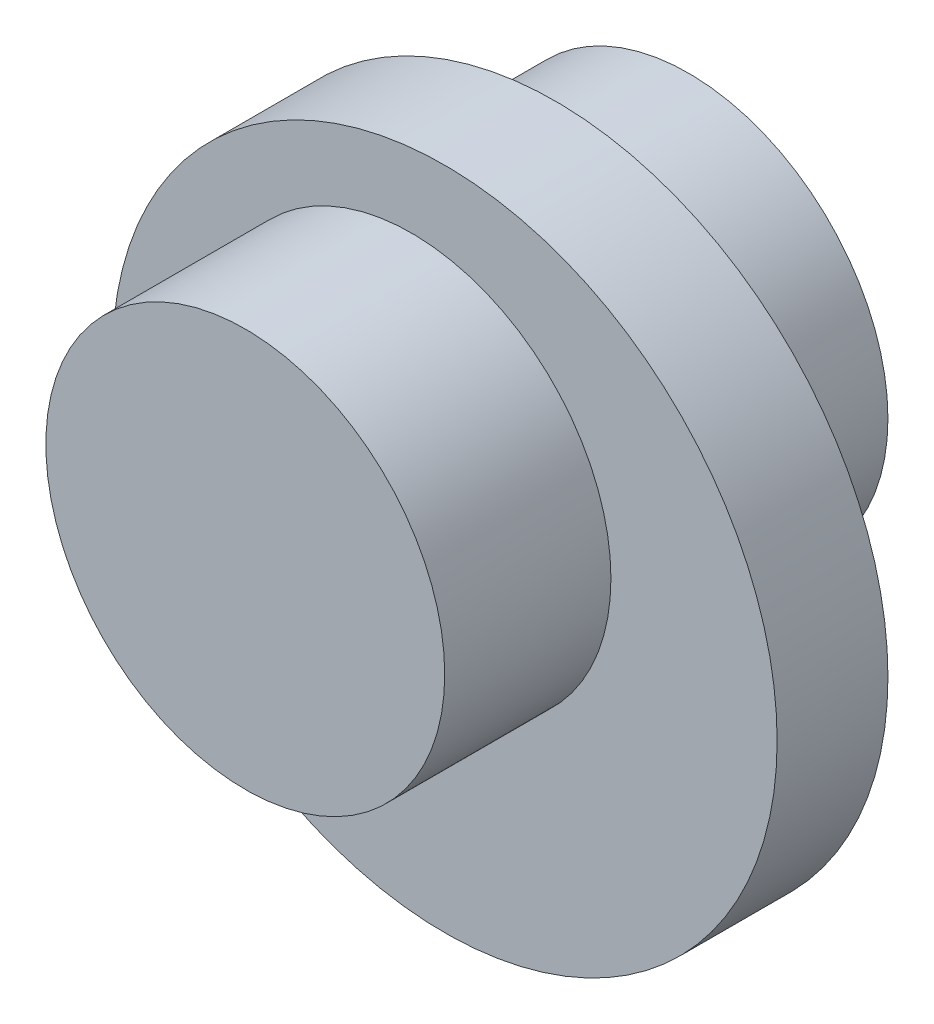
ISO-10303-21;
HEADER;
FILE_DESCRIPTION(('STEP AP214'),'2;1');
FILE_NAME('part.step','',(''),(''),'','','');
FILE_SCHEMA(('AUTOMOTIVE_DESIGN { 1 0 10303 214 1 1 1 1 }'));
ENDSEC;
DATA;
#1=APPLICATION_CONTEXT('core data for automotive mechanical design processes');
#2=APPLICATION_PROTOCOL_DEFINITION('international standard','automotive_design',2000,#1);
#3=PRODUCT_CONTEXT('',#1,'mechanical');
#4=PRODUCT('Part','Part','',(#3));
#5=PRODUCT_RELATED_PRODUCT_CATEGORY('part','',(#4));
#6=PRODUCT_DEFINITION_FORMATION('','',#4);
#7=PRODUCT_DEFINITION_CONTEXT('part definition',#1,'design');
#8=PRODUCT_DEFINITION('design','',#6,#7);
#9=PRODUCT_DEFINITION_SHAPE('','',#8);
#10=(LENGTH_UNIT() NAMED_UNIT(*) SI_UNIT(.MILLI.,.METRE.));
#11=(NAMED_UNIT(*) PLANE_ANGLE_UNIT() SI_UNIT($,.RADIAN.));
#12=(NAMED_UNIT(*) SI_UNIT($,.STERADIAN.) SOLID_ANGLE_UNIT());
#13=UNCERTAINTY_MEASURE_WITH_UNIT(LENGTH_MEASURE(1.E-05),#10,'distance_accuracy_value','');
#14=(GEOMETRIC_REPRESENTATION_CONTEXT(3) GLOBAL_UNCERTAINTY_ASSIGNED_CONTEXT((#13)) GLOBAL_UNIT_ASSIGNED_CONTEXT((#10,
#11,#12)) REPRESENTATION_CONTEXT('',''));
#15=CARTESIAN_POINT('',(0.,0.,0.));
#16=DIRECTION('',(0.,0.,1.));
#17=DIRECTION('',(1.,0.,0.));
#18=AXIS2_PLACEMENT_3D('',#15,#16,#17);
#19=CARTESIAN_POINT('',(0.,0.,10.));
#20=DIRECTION('',(0.,0.,-1.));
#21=DIRECTION('',(-1.,0.,0.));
#22=AXIS2_PLACEMENT_3D('',#19,#20,#21);
#23=CYLINDRICAL_SURFACE('',#22,9.);
#24=CARTESIAN_POINT('',(0.,0.,2.5));
#25=DIRECTION('',(0.,0.,1.));
#26=DIRECTION('',(1.,0.,0.));
#27=AXIS2_PLACEMENT_3D('',#24,#25,#26);
#28=CIRCLE('',#27,9.);
#29=CARTESIAN_POINT('',(9.,0.,2.5));
#30=VERTEX_POINT('',#29);
#31=EDGE_CURVE('E32',#30,#30,#28,.T.);
#32=ORIENTED_EDGE('',*,*,#31,.T.);
#33=EDGE_LOOP('',(#32));
#34=FACE_BOUND('',#33,.T.);
#35=CARTESIAN_POINT('',(0.,0.,10.));
#36=DIRECTION('',(0.,0.,1.));
#37=DIRECTION('',(1.,0.,0.));
#38=AXIS2_PLACEMENT_3D('',#35,#36,#37);
#39=CIRCLE('',#38,9.);
#40=CARTESIAN_POINT('',(9.,0.,10.));
#41=VERTEX_POINT('',#40);
#42=EDGE_CURVE('E36',#41,#41,#39,.T.);
#43=ORIENTED_EDGE('',*,*,#42,.F.);
#44=EDGE_LOOP('',(#43));
#45=FACE_BOUND('',#44,.T.);
#46=ADVANCED_FACE('F29',(#34,#45),#23,.T.);
#47=CARTESIAN_POINT('',(0.,0.,10.));
#48=DIRECTION('',(0.,0.,1.));
#49=DIRECTION('',(1.,0.,0.));
#50=AXIS2_PLACEMENT_3D('',#47,#48,#49);
#51=PLANE('',#50);
#52=ORIENTED_EDGE('',*,*,#42,.T.);
#53=EDGE_LOOP('',(#52));
#54=FACE_BOUND('',#53,.T.);
#55=ADVANCED_FACE('F60',(#54),#51,.T.);
#56=CARTESIAN_POINT('',(1.5,-2.59807621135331,2.5));
#57=DIRECTION('',(0.,0.,1.));
#58=DIRECTION('',(1.,0.,0.));
#59=AXIS2_PLACEMENT_3D('',#56,#57,#58);
#60=PLANE('',#59);
#61=CARTESIAN_POINT('',(1.5,-2.59807621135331,2.5));
#62=DIRECTION('',(0.,0.,1.));
#63=DIRECTION('',(1.,0.,0.));
#64=AXIS2_PLACEMENT_3D('',#61,#62,#63);
#65=CIRCLE('',#64,15.);
#66=CARTESIAN_POINT('',(16.5,-2.59807621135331,2.5));
#67=VERTEX_POINT('',#66);
#68=EDGE_CURVE('E48',#67,#67,#65,.T.);
#69=ORIENTED_EDGE('',*,*,#68,.T.);
#70=EDGE_LOOP('',(#69));
#71=FACE_BOUND('',#70,.T.);
#72=ORIENTED_EDGE('',*,*,#31,.F.);
#73=EDGE_LOOP('',(#72));
#74=FACE_BOUND('',#73,.T.);
#75=ADVANCED_FACE('F57',(#71,#74),#60,.T.);
#76=CARTESIAN_POINT('',(1.5,-2.59807621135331,-2.5));
#77=DIRECTION('',(0.,0.,1.));
#78=DIRECTION('',(1.,0.,0.));
#79=AXIS2_PLACEMENT_3D('',#76,#77,#78);
#80=PLANE('',#79);
#81=CARTESIAN_POINT('',(1.5,-2.59807621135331,-2.5));
#82=DIRECTION('',(0.,0.,1.));
#83=DIRECTION('',(1.,0.,0.));
#84=AXIS2_PLACEMENT_3D('',#81,#82,#83);
#85=CIRCLE('',#84,15.);
#86=CARTESIAN_POINT('',(16.5,-2.59807621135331,-2.5));
#87=VERTEX_POINT('',#86);
#88=EDGE_CURVE('E45',#87,#87,#85,.T.);
#89=ORIENTED_EDGE('',*,*,#88,.F.);
#90=EDGE_LOOP('',(#89));
#91=FACE_BOUND('',#90,.T.);
#92=CARTESIAN_POINT('',(0.,0.,-2.5));
#93=DIRECTION('',(0.,0.,1.));
#94=DIRECTION('',(1.,0.,0.));
#95=AXIS2_PLACEMENT_3D('',#92,#93,#94);
#96=CIRCLE('',#95,9.);
#97=CARTESIAN_POINT('',(9.,0.,-2.5));
#98=VERTEX_POINT('',#97);
#99=EDGE_CURVE('E10',#98,#98,#96,.T.);
#100=ORIENTED_EDGE('',*,*,#99,.T.);
#101=EDGE_LOOP('',(#100));
#102=FACE_BOUND('',#101,.T.);
#103=ADVANCED_FACE('F59',(#91,#102),#80,.F.);
#104=CARTESIAN_POINT('',(1.5,-2.59807621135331,2.5));
#105=DIRECTION('',(0.,0.,-1.));
#106=DIRECTION('',(-1.,0.,0.));
#107=AXIS2_PLACEMENT_3D('',#104,#105,#106);
#108=CYLINDRICAL_SURFACE('',#107,15.);
#109=ORIENTED_EDGE('',*,*,#68,.F.);
#110=EDGE_LOOP('',(#109));
#111=FACE_BOUND('',#110,.T.);
#112=ORIENTED_EDGE('',*,*,#88,.T.);
#113=EDGE_LOOP('',(#112));
#114=FACE_BOUND('',#113,.T.);
#115=ADVANCED_FACE('F66',(#111,#114),#108,.T.);
#116=CARTESIAN_POINT('',(0.,0.,-10.));
#117=DIRECTION('',(0.,0.,1.));
#118=DIRECTION('',(1.,0.,0.));
#119=AXIS2_PLACEMENT_3D('',#116,#117,#118);
#120=PLANE('',#119);
#121=CARTESIAN_POINT('',(0.,0.,-10.));
#122=DIRECTION('',(0.,0.,1.));
#123=DIRECTION('',(1.,0.,0.));
#124=AXIS2_PLACEMENT_3D('',#121,#122,#123);
#125=CIRCLE('',#124,9.);
#126=CARTESIAN_POINT('',(9.,0.,-10.));
#127=VERTEX_POINT('',#126);
#128=EDGE_CURVE('E40',#127,#127,#125,.T.);
#129=ORIENTED_EDGE('',*,*,#128,.F.);
#130=EDGE_LOOP('',(#129));
#131=FACE_BOUND('',#130,.T.);
#132=ADVANCED_FACE('F76',(#131),#120,.F.);
#133=ORIENTED_EDGE('',*,*,#128,.T.);
#134=EDGE_LOOP('',(#133));
#135=FACE_BOUND('',#134,.T.);
#136=ORIENTED_EDGE('',*,*,#99,.F.);
#137=EDGE_LOOP('',(#136));
#138=FACE_BOUND('',#137,.T.);
#139=ADVANCED_FACE('F72',(#135,#138),#23,.T.);
#140=CLOSED_SHELL('',(#46,#55,#75,#103,#115,#132,#139));
#141=MANIFOLD_SOLID_BREP('B2',#140);
#142=ADVANCED_BREP_SHAPE_REPRESENTATION('',(#18,#141),#14);
#143=SHAPE_DEFINITION_REPRESENTATION(#9,#142);
ENDSEC;
END-ISO-10303-21;
